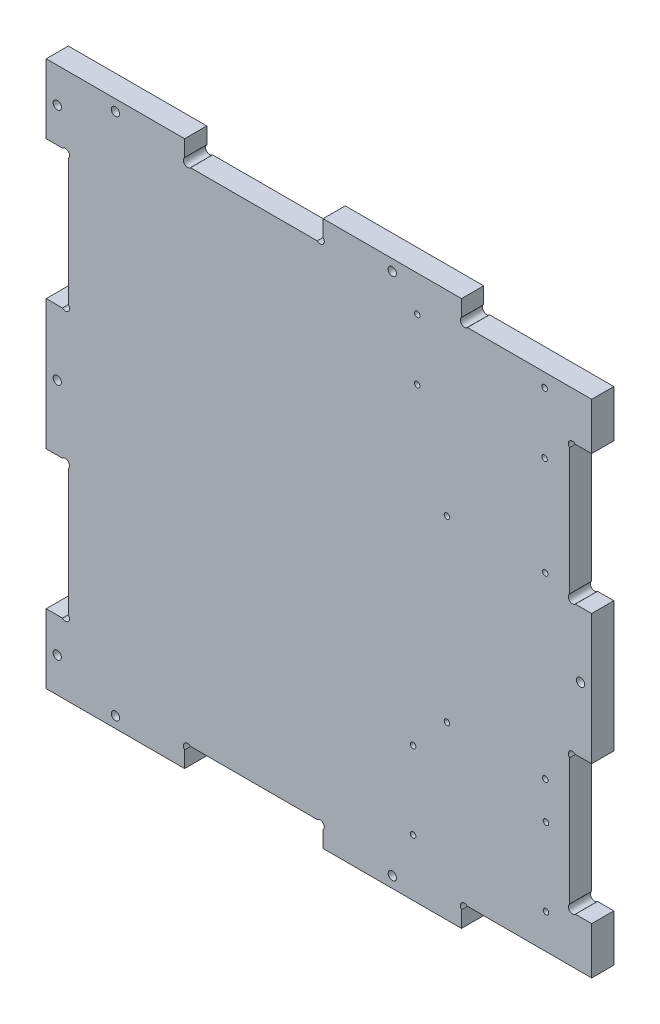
from build123d import *

# Parameters (mm, degrees)
ESQUISSE1_R        = 1.5
ESQUISSE1_R_2      = 1
BOSS_EXTRU_1_DEPTH = 8


with BuildPart() as part:
    # Esquisse1 → Boss.-Extru.1 (new body)
    with BuildSketch(Plane.XY):
        with BuildLine():
            Line((-37.796184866, -47.037596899), (-37.796184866, -94.037596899))
            Line((-37.796184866, -94.037596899), (-31.91750521, -94.037596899))
            ThreePointArc((-31.91750521, -94.037596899), (-29.796184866, -94.037596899), (-29.796184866, -96.158917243))
            Line((-29.796184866, -96.158917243), (-29.796184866, -141.916276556))
            ThreePointArc((-29.796184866, -141.916276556), (-29.796184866, -144.037596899), (-31.91750521, -144.037596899))
            Line((-31.91750521, -144.037596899), (-37.796184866, -144.037596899))
            Line((-37.796184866, -144.037596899), (-37.796184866, -169.037596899))
            Line((-37.796184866, -169.037596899), (-29.796184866, -169.037596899))
            Line((-29.796184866, -169.037596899), (12.203815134, -169.037596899))
            Line((12.203815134, -169.037596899), (12.203815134, -163.158917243))
            ThreePointArc((12.203815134, -163.158917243), (12.203815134, -161.0375969), (14.325135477, -161.037596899))
            Line((14.325135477, -161.037596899), (60.08249479, -161.037596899))
            ThreePointArc((60.08249479, -161.037596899), (62.203815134, -161.037596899), (62.203815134, -163.158917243))
            Line((62.203815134, -163.158917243), (62.203815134, -169.037596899))
            Line((62.203815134, -169.037596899), (112.203815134, -169.037596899))
            Line((112.203815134, -169.037596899), (112.203815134, -163.158917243))
            ThreePointArc((112.203815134, -163.158917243), (112.203815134, -161.037596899), (114.325135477, -161.037596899))
            Line((114.325135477, -161.037596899), (159.203815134, -161.037596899))
            Line((159.203815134, -161.037596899), (159.203815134, -144.037596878))
            Line((159.203815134, -144.037596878), (153.325135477, -144.037596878))
            ThreePointArc((153.325135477, -144.037596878), (151.203815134, -144.037596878), (151.203815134, -141.916276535))
            Line((151.203815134, -141.916276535), (151.203815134, -96.158917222))
            ThreePointArc((151.203815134, -96.158917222), (151.203815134, -94.037596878), (153.325135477, -94.037596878))
            Line((153.325135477, -94.037596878), (159.203815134, -94.037596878))
            Line((159.203815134, -94.037596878), (159.203815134, -47.037596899))
            Line((159.203815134, -47.037596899), (153.325135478, -47.037596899))
            ThreePointArc((153.325135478, -47.037596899), (151.203815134, -47.037596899), (151.203815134, -44.916276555))
            Line((151.203815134, -44.916276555), (151.203815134, 0.841082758))
            ThreePointArc((151.203815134, 0.841082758), (151.203815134, 2.962403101), (153.325135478, 2.962403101))
            Line((153.325135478, 2.962403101), (159.203815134, 2.962403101))
            Line((159.203815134, 2.962403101), (159.203815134, 19.962403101))
            Line((159.203815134, 19.962403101), (114.325135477, 19.962403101))
            ThreePointArc((114.325135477, 19.962403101), (112.203815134, 19.962403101), (112.203815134, 22.083723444))
            Line((112.203815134, 22.083723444), (112.203815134, 27.962403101))
            Line((112.203815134, 27.962403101), (62.203815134, 27.962403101))
            Line((62.203815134, 27.962403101), (62.203815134, 22.083723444))
            ThreePointArc((62.203815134, 22.083723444), (62.203815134, 19.962403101), (60.08249479, 19.962403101))
            Line((60.08249479, 19.962403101), (14.325135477, 19.962403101))
            ThreePointArc((14.325135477, 19.962403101), (12.203815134, 19.962403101), (12.203815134, 22.083723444))
            Line((12.203815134, 22.083723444), (12.203815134, 27.962403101))
            Line((12.203815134, 27.962403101), (-29.796184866, 27.962403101))
            Line((-29.796184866, 27.962403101), (-37.796184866, 27.962403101))
            Line((-37.796184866, 27.962403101), (-37.796184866, 2.962403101))
            Line((-37.796184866, 2.962403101), (-31.91750521, 2.962403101))
            ThreePointArc((-31.91750521, 2.962403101), (-29.796184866, 2.962403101), (-29.796184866, 0.841082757))
            Line((-29.796184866, 0.841082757), (-29.796184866, -44.916276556))
            ThreePointArc((-29.796184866, -44.916276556), (-29.796184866, -47.037596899), (-31.91750521, -47.037596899))
            Line((-31.91750521, -47.037596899), (-37.796184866, -47.037596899))
        make_face()
        with Locations((155.203815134, -70.537596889)):
            Circle(ESQUISSE1_R, mode=Mode.SUBTRACT)
        with Locations(Location((-33.796184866, 15.462403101, 0), (0, 0, 180))):
            Circle(ESQUISSE1_R, mode=Mode.SUBTRACT)
        with Locations(Location((-12.796184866, 23.962403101, 0), (0, 0, 180))):
            Circle(ESQUISSE1_R, mode=Mode.SUBTRACT)
        with Locations(Location((87.203815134, 23.962403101, 0), (0, 0, 180))):
            Circle(ESQUISSE1_R, mode=Mode.SUBTRACT)
        with Locations((87.203815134, -165.037596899)):
            Circle(ESQUISSE1_R, mode=Mode.SUBTRACT)
        with Locations((-12.796184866, -165.037596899)):
            Circle(ESQUISSE1_R, mode=Mode.SUBTRACT)
        with Locations((-33.796184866, -156.537596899)):
            Circle(ESQUISSE1_R, mode=Mode.SUBTRACT)
        with Locations((142.203815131, 15.063358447)):
            Circle(ESQUISSE1_R_2, mode=Mode.SUBTRACT)
        with Locations((-33.796184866, -70.537596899)):
            Circle(ESQUISSE1_R, mode=Mode.SUBTRACT)
        with Locations((142.203815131, -6.936641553)):
            Circle(ESQUISSE1_R_2, mode=Mode.SUBTRACT)
        with Locations((96.203815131, -6.936641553)):
            Circle(ESQUISSE1_R_2, mode=Mode.SUBTRACT)
        with Locations((96.203815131, 15.063358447)):
            Circle(ESQUISSE1_R_2, mode=Mode.SUBTRACT)
        with Locations((142.453815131, -42.686641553)):
            Circle(ESQUISSE1_R_2, mode=Mode.SUBTRACT)
        with Locations((106.953815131, -42.686641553)):
            Circle(ESQUISSE1_R_2, mode=Mode.SUBTRACT)
        with Locations((142.453815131, -107.186641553)):
            Circle(ESQUISSE1_R_2, mode=Mode.SUBTRACT)
        with Locations((106.953815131, -107.186641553)):
            Circle(ESQUISSE1_R_2, mode=Mode.SUBTRACT)
        with Locations((142.703815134, -120.537596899)):
            Circle(ESQUISSE1_R_2, mode=Mode.SUBTRACT)
        with Locations((94.703815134, -120.537596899)):
            Circle(ESQUISSE1_R_2, mode=Mode.SUBTRACT)
        with Locations((94.703815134, -148.537596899)):
            Circle(ESQUISSE1_R_2, mode=Mode.SUBTRACT)
        with Locations((142.703815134, -148.537596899)):
            Circle(ESQUISSE1_R_2, mode=Mode.SUBTRACT)
    extrude(amount=BOSS_EXTRU_1_DEPTH)


solid = part.part
